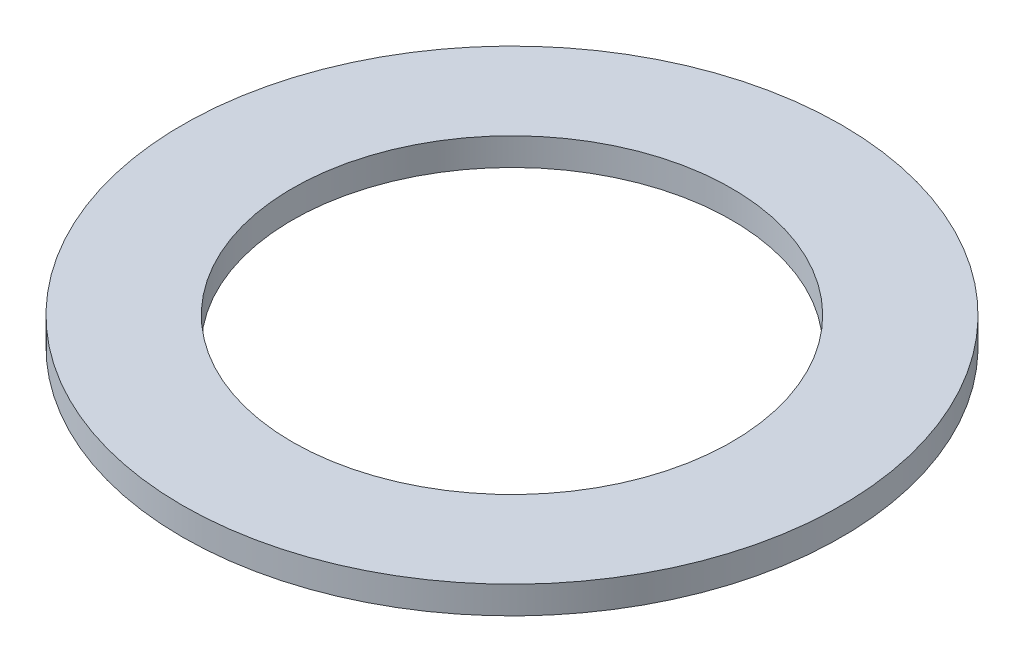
from build123d import *

# Parameters (mm, degrees)
SKETCH1_R           = 38.1
SKETCH1_R_2         = 25.4
BOSS_EXTRUDE1_DEPTH = 3.175


with BuildPart() as part:
    # Sketch1 → Boss-Extrude1 (new body)
    with BuildSketch(Plane(origin=(0, 0, 0), x_dir=(1, 0, 0), z_dir=(0, 1, 0))):
        with Locations(Location((0, 0, 0), (0, 0, 270))):
            Circle(SKETCH1_R)
        with Locations(Location((0, 0, 0), (0, 0, 270))):
            Circle(SKETCH1_R_2, mode=Mode.SUBTRACT)
    extrude(amount=BOSS_EXTRUDE1_DEPTH)


solid = part.part
